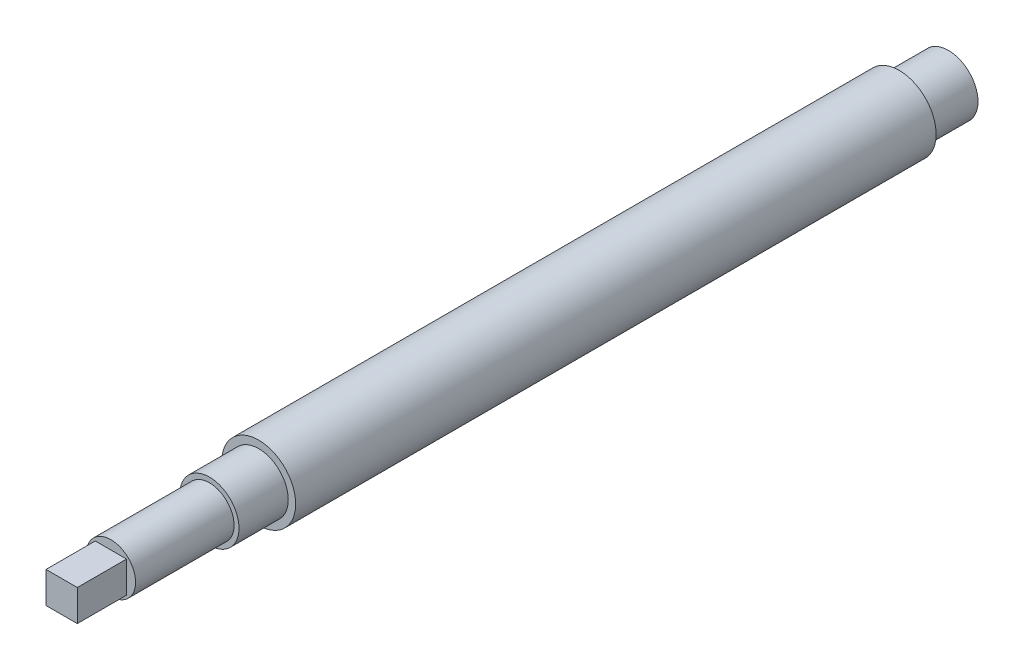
from build123d import *

# Parameters (mm, degrees)
CROQUIS1_R     = 7.5
EXTRUIR2_DEPTH = 130
CROQUIS3_R     = 6
EXTRUIR3_DEPTH = 10
EXTRUIR4_START = 10
CROQUIS4_R     = 6
EXTRUIR4_DEPTH = 10
CROQUIS5_R     = 5
EXTRUIR5_DEPTH = 20
CROQUIS6_W     = 6.35
CROQUIS6_H     = 6.35
EXTRUIR6_DEPTH = 10


with BuildPart() as part:
    # Croquis1 → Extruir2 (new body)
    with BuildSketch(Plane.XY):
        Circle(CROQUIS1_R)
    extrude(amount=EXTRUIR2_DEPTH)

    # Croquis3 → Extruir3 (add)
    with BuildSketch(Plane.XY.offset(130)):
        Circle(CROQUIS3_R)
    extrude(amount=EXTRUIR3_DEPTH)

    # Croquis4 → Extruir4 (add)
    with BuildSketch(Plane(origin=(0, 0, 0), x_dir=(-1, 0, 0), z_dir=(0, 0, -1)).offset(EXTRUIR4_START)):
        with Locations(Location((0, 0, 0), (0, 0, 180))):
            Circle(CROQUIS4_R)
    extrude(amount=-EXTRUIR4_DEPTH)

    # Croquis5 → Extruir5 (add)
    with BuildSketch(Plane.XY.offset(140)):
        Circle(CROQUIS5_R)
    extrude(amount=EXTRUIR5_DEPTH)

    # Croquis6 → Extruir6 (add)
    with BuildSketch(Plane.XY.offset(160)):
        Rectangle(CROQUIS6_W, CROQUIS6_H)
    extrude(amount=EXTRUIR6_DEPTH)


solid = part.part
